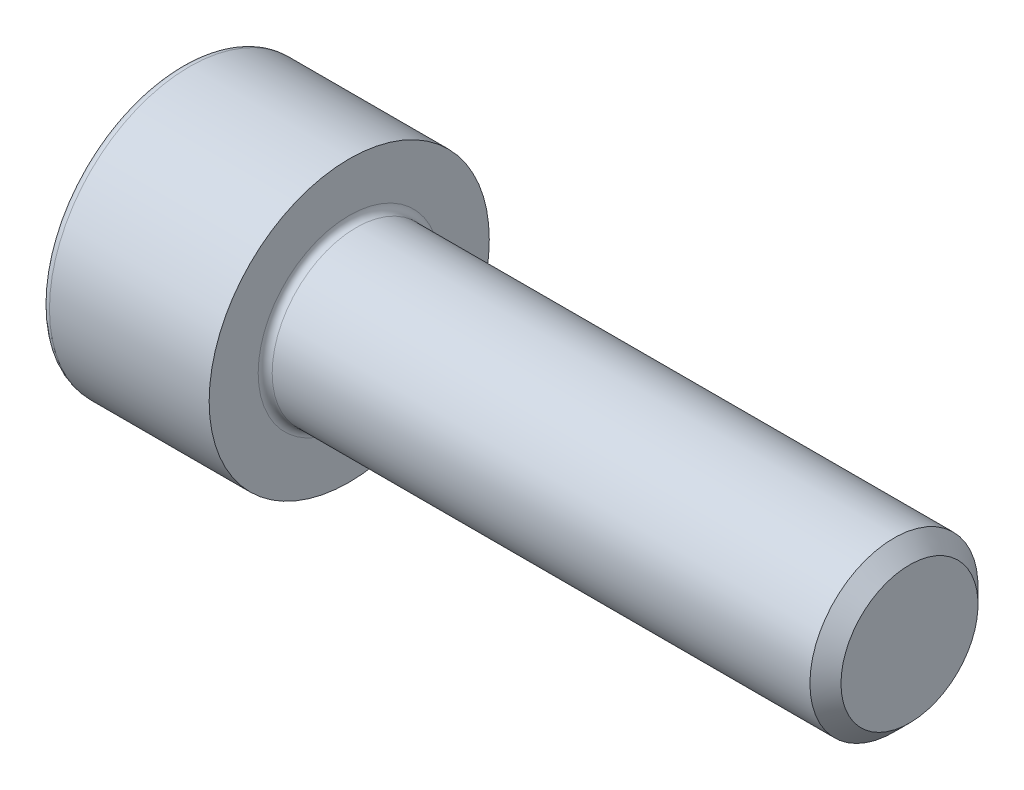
from build123d import *

# Parameters (mm, degrees)
FILLET1_R   = 0.25
FILLET2_R   = 0.3
HEX_2_DEPTH = 3


with BuildPart() as part:
    # BodySke → Base-Revolve (revolve)
    with BuildSketch(Plane.XY, mode=Mode.PRIVATE) as base_revolve_sk:
        Polygon((0, 0), (0, 5), (6, 5), (6, 3), (25.4455, 3), (26, 2.4455), (26, 0), align=None)
    revolve(base_revolve_sk.sketch.rotate(Axis((-31.75, 0, 0), (1, 0, 0)), 90), axis=Axis((-31.75, 0, 0), (1, 0, 0)))

    # Fillet1
    fillet1_edges = [part.edges().sort_by_distance(p)[0] for p in [
        (6, 0, -3),
    ]]
    fillet(fillet1_edges, radius=FILLET1_R)

    # Fillet2
    fillet2_edges = [part.edges().sort_by_distance(p)[0] for p in [
        (0, 0, -5),
    ]]
    fillet(fillet2_edges, radius=FILLET2_R)

    # Sketch2 → Hex-PreBroach (revolve, cut)
    with BuildSketch(Plane.XY, mode=Mode.PRIVATE) as hex_prebroach_sk:
        Polygon((0, 2.542), (3, 2.542), (4.467624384, 0), (0, 0), align=None)
    revolve(hex_prebroach_sk.sketch.rotate(Axis((0, 0, 0), (1, 0, 0)), 90), axis=Axis((0, 0, 0), (1, 0, 0)), mode=Mode.SUBTRACT)

    # Sketch3 → Hex 2 (cut)
    with BuildSketch(Plane(origin=(0, 0, 0), x_dir=(0, 0.500000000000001, 0.866025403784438), z_dir=(-1, 0, 0))):
        Polygon((1.467624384, 2.542), (-1.467624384, 2.542), (-2.935248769, 0), (-1.467624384, -2.542), (1.467624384, -2.542), (2.935248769, 0), align=None)
    extrude(amount=-HEX_2_DEPTH, mode=Mode.SUBTRACT)


solid = part.part
